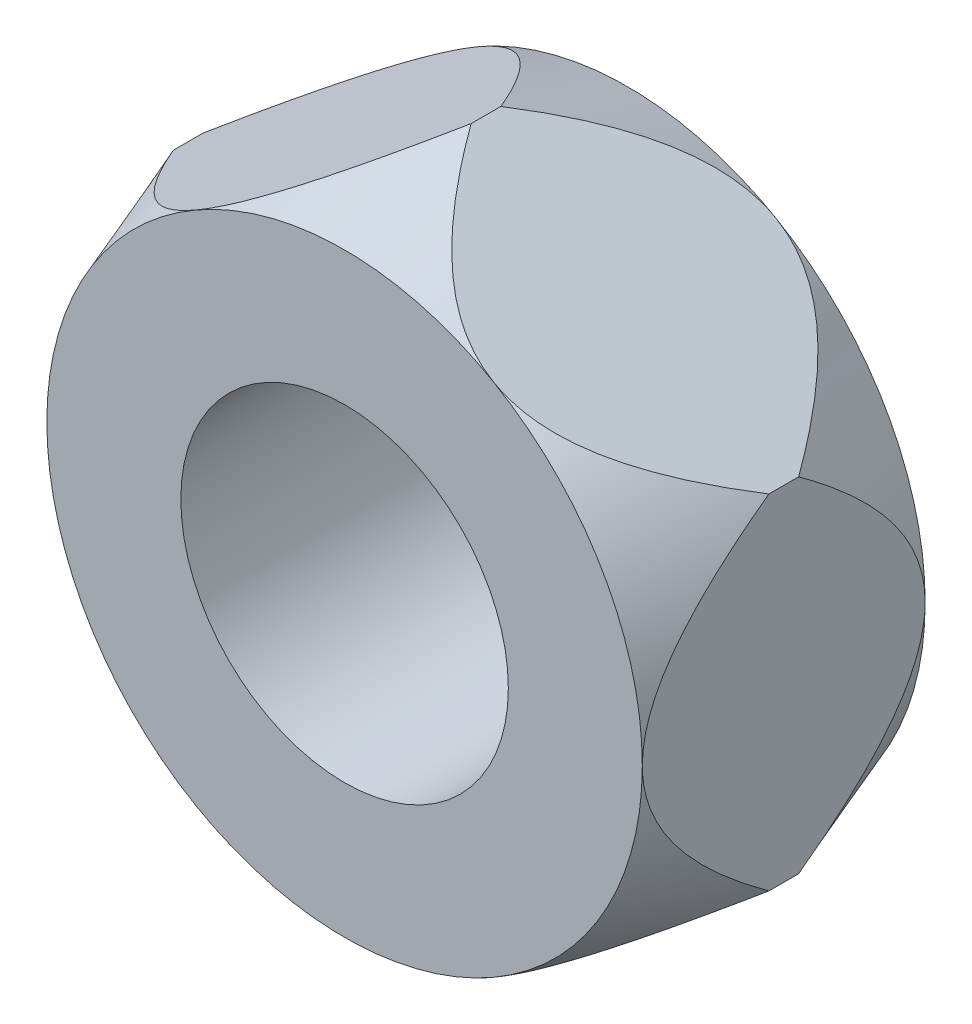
from build123d import *

# Parameters (mm, degrees)
BOSS_EXTRUDE1_DEPTH = 4.75
SKETCH2_OUTSIDE_W   = 22.474
SKETCH2_OUTSIDE_H   = 24.022
SKETCH2_OUTSIDE_R   = 5
CUT_EXTRUDE1_DEPTH  = 9.994211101
CUT_EXTRUDE1_DRAFT  = -20
SKETCH3_OUTSIDE_W   = 22.474
SKETCH3_OUTSIDE_H   = 24.022
SKETCH3_OUTSIDE_R   = 5
CUT_EXTRUDE2_DEPTH  = 9.994211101
CUT_EXTRUDE2_DRAFT  = -20
SKETCH4_R           = 2.75
CUT_EXTRUDE3_DEPTH  = 4.75


with BuildPart() as part:
    # Sketch1 → Boss-Extrude1 (new body)
    with BuildSketch(Plane.XY):
        Polygon((0, 5.773502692), (-5, 2.886751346), (-5, -2.886751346), (0, -5.773502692), (5, -2.886751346), (5, 2.886751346), align=None)
    extrude(amount=BOSS_EXTRUDE1_DEPTH)


with BuildPart() as cut_extrude1_tool:
    # Sketch2 outside → Cut-Extrude1 (with draft: the straight prism first)
    with BuildSketch(Plane.XY.offset(4.75)):
        Rectangle(SKETCH2_OUTSIDE_W, SKETCH2_OUTSIDE_H)
        Circle(SKETCH2_OUTSIDE_R, mode=Mode.SUBTRACT)
    extrude(amount=-CUT_EXTRUDE1_DEPTH)
    # Cut-Extrude1: the draft: its side faces are tilted about the plane it starts from
    cut_extrude1_sides = [cut_extrude1_tool.faces().sort_by_distance(p)[0] for p in [
        (0, -12.011, -0.247105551),
        (11.237, 0, -0.247105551),
        (0, 12.011, -0.247105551),
        (-11.237, 0, -0.247105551),
        (-5, 0, -0.247105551),
    ]]
    draft(cut_extrude1_sides, Plane.XY.offset(4.75), CUT_EXTRUDE1_DRAFT)


with BuildPart() as part_1:
    add(part.part)

    # Cut-Extrude1: cut by cut_extrude1_tool
    add(cut_extrude1_tool.part, mode=Mode.SUBTRACT)


with BuildPart() as cut_extrude2_tool:
    # Sketch3 outside → Cut-Extrude2 (with draft: the straight prism first)
    with BuildSketch(Plane(origin=(0, 0, 0), x_dir=(-1, 0, 0), z_dir=(0, 0, -1))):
        Rectangle(SKETCH3_OUTSIDE_W, SKETCH3_OUTSIDE_H)
        Circle(SKETCH3_OUTSIDE_R, mode=Mode.SUBTRACT)
    extrude(amount=-CUT_EXTRUDE2_DEPTH)
    # Cut-Extrude2: the draft: its side faces are tilted about the plane it starts from
    cut_extrude2_sides = [cut_extrude2_tool.faces().sort_by_distance(p)[0] for p in [
        (0, -12.011, 4.997105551),
        (-11.237, 0, 4.997105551),
        (0, 12.011, 4.997105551),
        (11.237, 0, 4.997105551),
        (5, 0, 4.997105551),
    ]]
    draft(cut_extrude2_sides, Plane(origin=(0, 0, 0), x_dir=(-1, 0, 0), z_dir=(0, 0, -1)), CUT_EXTRUDE2_DRAFT)


with BuildPart() as part_2:
    add(part_1.part)

    # Cut-Extrude2: cut by cut_extrude2_tool
    add(cut_extrude2_tool.part, mode=Mode.SUBTRACT)

    # Sketch4 → Cut-Extrude3 (cut)
    with BuildSketch(Plane(origin=(0, 0, 0), x_dir=(-1, 0, 0), z_dir=(0, 0, -1))):
        Circle(SKETCH4_R)
    extrude(amount=-CUT_EXTRUDE3_DEPTH, mode=Mode.SUBTRACT)


solid = part_2.part
